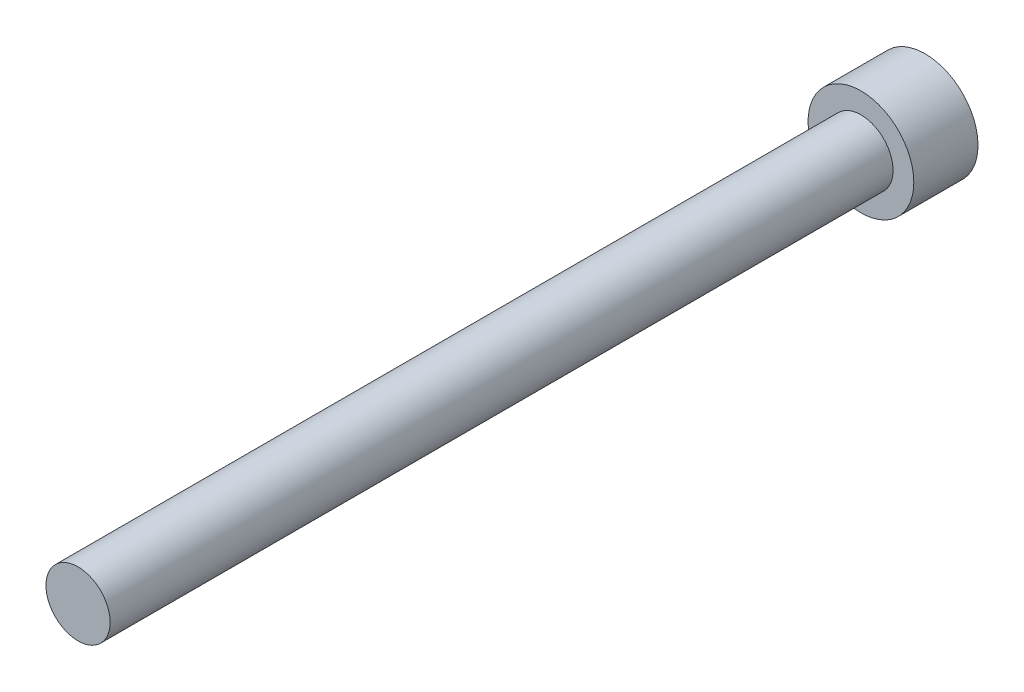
from build123d import *

# Parameters (mm, degrees)
HEX_2_DEPTH = 2.794


with BuildPart() as part:
    # Sketch6 → Revolve1 (revolve)
    with BuildSketch(Plane(origin=(0, 0, 0), x_dir=(0, 0, -1), z_dir=(1, 0, 0)), mode=Mode.PRIVATE) as revolve1_sk:
        Polygon((-50.8, 0), (-50.8, -2.0828), (0, -2.0828), (0, -3.429), (4.1656, -3.429), (4.1656, 0), align=None)
    revolve(revolve1_sk.sketch.rotate(Axis((0, 0, 50.8), (0, 0, -1)), 270), axis=Axis((0, 0, 50.8), (0, 0, -1)))

    # Sketch7 → HEX 2 (cut)
    with BuildSketch(Plane(origin=(0, 0, -4.1656), x_dir=(-1, 0, 0), z_dir=(0, 0, -1))):
        Polygon((-1.778, 1.026528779), (-1.778, -1.026528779), (0, -2.053057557), (1.778, -1.026528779), (1.778, 1.026528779), (0, 2.053057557), align=None)
    extrude(amount=-HEX_2_DEPTH, mode=Mode.SUBTRACT)


solid = part.part
